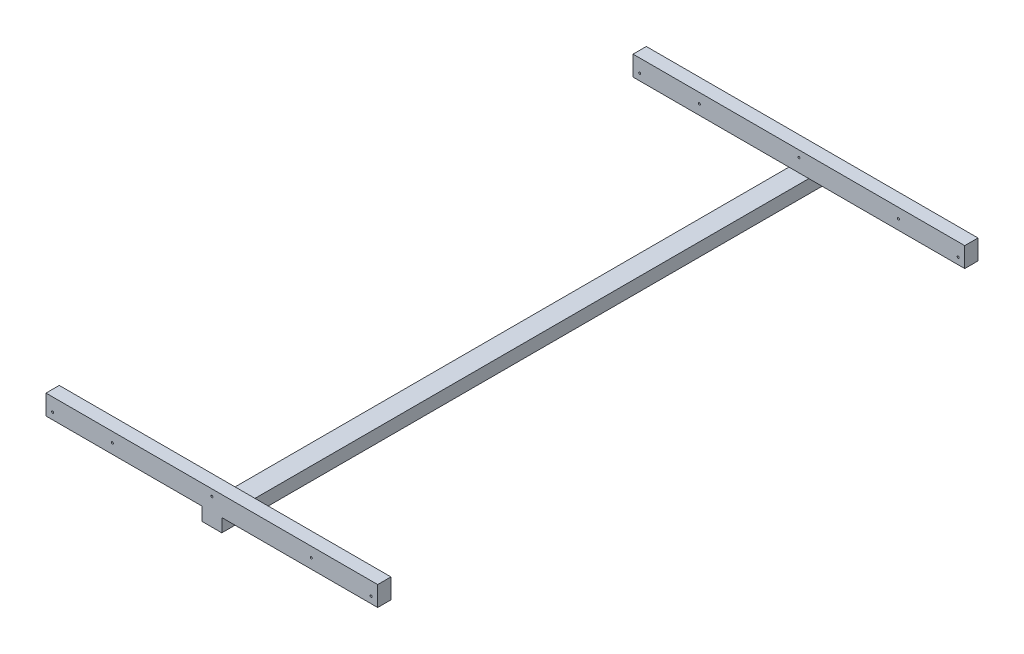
from build123d import *

# Parameters (mm, degrees)
ESQUISSE1_W                  = 60
ESQUISSE1_H                  = 40
BOSS_EXTRU_1_DEPTH           = 905
ESQUISSE2_W                  = 40
ESQUISSE2_H                  = 60
BOSS_EXTRU_2_DEPTH           = 500
ENL_V_MAT_EXTRU_1_DEPTH      = 1880.494612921
ENL_V_MAT_EXTRU_1_DEPTH_BACK = 1880.494612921
ESQUISSE3_R                  = 3


with BuildPart() as part:
    # Esquisse1 → Boss.-Extru.1 (new, symmetric)
    with BuildSketch(Plane.XY):
        Rectangle(ESQUISSE1_W, ESQUISSE1_H)
    extrude(amount=BOSS_EXTRU_1_DEPTH, both=True)

    # Esquisse2 → Boss.-Extru.2 (add, symmetric)
    with BuildSketch(Plane(origin=(0, 0, 0), x_dir=(0, 0, -1), z_dir=(1, 0, 0))):
        with Locations((-885, 50)):
            Rectangle(ESQUISSE2_W, ESQUISSE2_H)
        with Locations((885, 50)):
            Rectangle(ESQUISSE2_W, ESQUISSE2_H)
    extrude(amount=BOSS_EXTRU_2_DEPTH, both=True)

    # Esquisse3 → Enl_v. mat.-Extru.1 (cut, two sides: drawn at the far end of the back side and taken through both)
    with BuildSketch(Plane.XY.offset(905).offset(-ENL_V_MAT_EXTRU_1_DEPTH_BACK)):
        with Locations((0, 60)):
            Circle(ESQUISSE3_R)
        with Locations((480, 40)):
            Circle(ESQUISSE3_R)
        with Locations(Location((-480, 40, 0), (0, 0, 180))):
            Circle(ESQUISSE3_R)
        with Locations((-300, 50)):
            Circle(ESQUISSE3_R)
        with Locations(Location((300, 50, 0), (0, 0, 180))):
            Circle(ESQUISSE3_R)
    extrude(amount=ENL_V_MAT_EXTRU_1_DEPTH + ENL_V_MAT_EXTRU_1_DEPTH_BACK, mode=Mode.SUBTRACT)


solid = part.part
